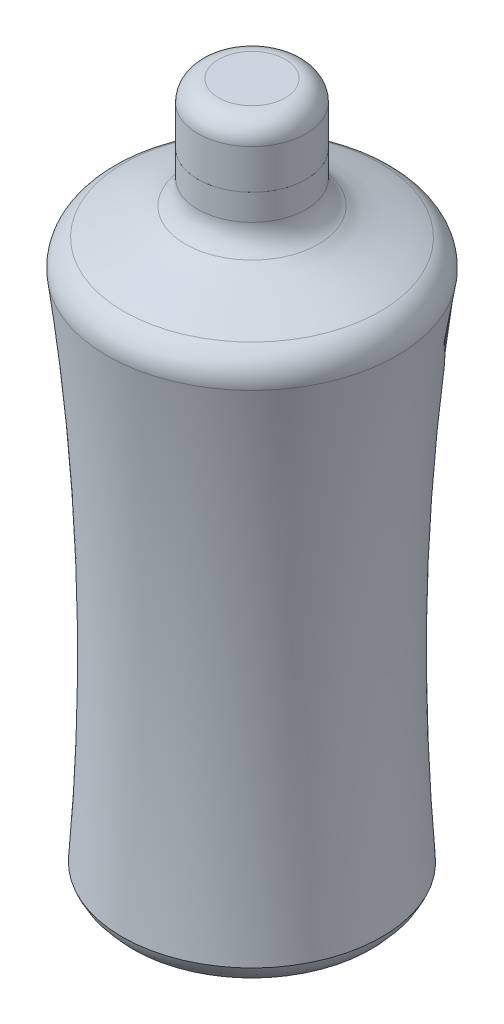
ISO-10303-21;
HEADER;
FILE_DESCRIPTION(('STEP AP214'),'2;1');
FILE_NAME('part.step','',(''),(''),'','','');
FILE_SCHEMA(('AUTOMOTIVE_DESIGN { 1 0 10303 214 1 1 1 1 }'));
ENDSEC;
DATA;
#1=APPLICATION_CONTEXT('core data for automotive mechanical design processes');
#2=APPLICATION_PROTOCOL_DEFINITION('international standard','automotive_design',2000,#1);
#3=PRODUCT_CONTEXT('',#1,'mechanical');
#4=PRODUCT('Part','Part','',(#3));
#5=PRODUCT_RELATED_PRODUCT_CATEGORY('part','',(#4));
#6=PRODUCT_DEFINITION_FORMATION('','',#4);
#7=PRODUCT_DEFINITION_CONTEXT('part definition',#1,'design');
#8=PRODUCT_DEFINITION('design','',#6,#7);
#9=PRODUCT_DEFINITION_SHAPE('','',#8);
#10=(LENGTH_UNIT() NAMED_UNIT(*) SI_UNIT(.MILLI.,.METRE.));
#11=(NAMED_UNIT(*) PLANE_ANGLE_UNIT() SI_UNIT($,.RADIAN.));
#12=(NAMED_UNIT(*) SI_UNIT($,.STERADIAN.) SOLID_ANGLE_UNIT());
#13=UNCERTAINTY_MEASURE_WITH_UNIT(LENGTH_MEASURE(1.E-05),#10,'distance_accuracy_value','');
#14=(GEOMETRIC_REPRESENTATION_CONTEXT(3) GLOBAL_UNCERTAINTY_ASSIGNED_CONTEXT((#13)) GLOBAL_UNIT_ASSIGNED_CONTEXT((#10,
#11,#12)) REPRESENTATION_CONTEXT('',''));
#15=CARTESIAN_POINT('',(0.,0.,0.));
#16=DIRECTION('',(0.,0.,1.));
#17=DIRECTION('',(1.,0.,0.));
#18=AXIS2_PLACEMENT_3D('',#15,#16,#17);
#19=CARTESIAN_POINT('',(0.,395.100887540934,0.));
#20=DIRECTION('',(0.,1.,0.));
#21=DIRECTION('',(0.,0.,1.));
#22=AXIS2_PLACEMENT_3D('',#19,#20,#21);
#23=PLANE('',#22);
#24=CARTESIAN_POINT('',(0.,395.100887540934,0.));
#25=DIRECTION('',(0.,1.,0.));
#26=DIRECTION('',(0.,0.,1.));
#27=AXIS2_PLACEMENT_3D('',#24,#25,#26);
#28=CIRCLE('',#27,33.0657505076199);
#29=CARTESIAN_POINT('',(0.,395.100887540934,33.0657505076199));
#30=VERTEX_POINT('',#29);
#31=EDGE_CURVE('E11',#30,#30,#28,.T.);
#32=ORIENTED_EDGE('',*,*,#31,.F.);
#33=EDGE_LOOP('',(#32));
#34=FACE_BOUND('',#33,.T.);
#35=ADVANCED_FACE('F42',(#34),#23,.F.);
#36=CARTESIAN_POINT('',(0.,431.942700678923,0.));
#37=DIRECTION('',(0.,1.,0.));
#38=DIRECTION('',(0.,0.,1.));
#39=AXIS2_PLACEMENT_3D('',#36,#37,#38);
#40=CYLINDRICAL_SURFACE('',#39,33.0657505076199);
#41=CARTESIAN_POINT('',(0.,419.242700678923,0.));
#42=DIRECTION('',(0.,1.,0.));
#43=DIRECTION('',(0.,0.,1.));
#44=AXIS2_PLACEMENT_3D('',#41,#42,#43);
#45=CIRCLE('',#44,33.0657505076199);
#46=CARTESIAN_POINT('',(0.,419.242700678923,33.0657505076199));
#47=VERTEX_POINT('',#46);
#48=EDGE_CURVE('E48',#47,#47,#45,.T.);
#49=ORIENTED_EDGE('',*,*,#48,.F.);
#50=EDGE_LOOP('',(#49));
#51=FACE_BOUND('',#50,.T.);
#52=ORIENTED_EDGE('',*,*,#31,.T.);
#53=EDGE_LOOP('',(#52));
#54=FACE_BOUND('',#53,.T.);
#55=ADVANCED_FACE('F63',(#51,#54),#40,.T.);
#56=CARTESIAN_POINT('',(0.,419.242700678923,0.));
#57=DIRECTION('',(0.,1.,0.));
#58=DIRECTION('',(0.,0.,1.));
#59=AXIS2_PLACEMENT_3D('',#56,#57,#58);
#60=TOROIDAL_SURFACE('',#59,20.3657505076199,12.7);
#61=CARTESIAN_POINT('',(0.,431.942700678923,0.));
#62=DIRECTION('',(0.,1.,0.));
#63=DIRECTION('',(0.,0.,1.));
#64=AXIS2_PLACEMENT_3D('',#61,#62,#63);
#65=CIRCLE('',#64,20.3657505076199);
#66=CARTESIAN_POINT('',(0.,431.942700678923,20.3657505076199));
#67=VERTEX_POINT('',#66);
#68=EDGE_CURVE('E52',#67,#67,#65,.T.);
#69=ORIENTED_EDGE('',*,*,#68,.F.);
#70=EDGE_LOOP('',(#69));
#71=FACE_BOUND('',#70,.T.);
#72=ORIENTED_EDGE('',*,*,#48,.T.);
#73=EDGE_LOOP('',(#72));
#74=FACE_BOUND('',#73,.T.);
#75=ADVANCED_FACE('F61',(#71,#74),#60,.T.);
#76=CARTESIAN_POINT('',(20.3657505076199,431.942700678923,0.));
#77=DIRECTION('',(0.,-1.,0.));
#78=DIRECTION('',(0.,0.,-1.));
#79=AXIS2_PLACEMENT_3D('',#76,#77,#78);
#80=PLANE('',#79);
#81=ORIENTED_EDGE('',*,*,#68,.T.);
#82=EDGE_LOOP('',(#81));
#83=FACE_BOUND('',#82,.T.);
#84=ADVANCED_FACE('F59',(#83),#80,.F.);
#85=CLOSED_SHELL('',(#35,#55,#75,#84));
#86=MANIFOLD_SOLID_BREP('B2',#85);
#87=CARTESIAN_POINT('',(33.0839169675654,395.100887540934,0.));
#88=DIRECTION('',(0.,-1.,0.));
#89=DIRECTION('',(0.,0.,-1.));
#90=AXIS2_PLACEMENT_3D('',#87,#88,#89);
#91=PLANE('',#90);
#92=CARTESIAN_POINT('',(0.,395.100887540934,0.));
#93=DIRECTION('',(0.,1.,0.));
#94=DIRECTION('',(0.,0.,1.));
#95=AXIS2_PLACEMENT_3D('',#92,#93,#94);
#96=CIRCLE('',#95,33.0839169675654);
#97=CARTESIAN_POINT('',(0.,395.100887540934,33.0839169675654));
#98=VERTEX_POINT('',#97);
#99=EDGE_CURVE('E117',#98,#98,#96,.T.);
#100=ORIENTED_EDGE('',*,*,#99,.T.);
#101=EDGE_LOOP('',(#100));
#102=FACE_BOUND('',#101,.T.);
#103=CARTESIAN_POINT('',(0.,395.100887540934,0.));
#104=DIRECTION('',(0.,-1.,0.));
#105=DIRECTION('',(0.,0.,-1.));
#106=AXIS2_PLACEMENT_3D('',#103,#104,#105);
#107=CIRCLE('',#106,32.5759169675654);
#108=CARTESIAN_POINT('',(0.,395.100887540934,-32.5759169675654));
#109=VERTEX_POINT('',#108);
#110=EDGE_CURVE('E361',#109,#109,#107,.F.);
#111=ORIENTED_EDGE('',*,*,#110,.F.);
#112=EDGE_LOOP('',(#111));
#113=FACE_BOUND('',#112,.T.);
#114=ADVANCED_FACE('F97',(#102,#113),#91,.F.);
#115=CARTESIAN_POINT('',(79.3997741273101,17.0680698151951,0.));
#116=CARTESIAN_POINT('',(71.9626708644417,121.488373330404,0.));
#117=CARTESIAN_POINT('',(75.0376861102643,225.653277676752,0.));
#118=CARTESIAN_POINT('',(88.6205273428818,329.428470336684,0.));
#119=B_SPLINE_CURVE_WITH_KNOTS('',3,(#115,#116,#117,#118),.UNSPECIFIED.,.F.,.F.,(4,4),(0.,
0.960351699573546),.UNSPECIFIED.);
#120=CARTESIAN_POINT('',(0.,395.100887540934,0.));
#121=DIRECTION('',(0.,1.,0.));
#122=AXIS1_PLACEMENT('',#120,#121);
#123=SURFACE_OF_REVOLUTION('',#119,#122);
#124=CARTESIAN_POINT('',(0.,329.428470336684,0.));
#125=DIRECTION('',(0.,1.,0.));
#126=DIRECTION('',(0.,0.,1.));
#127=AXIS2_PLACEMENT_3D('',#124,#125,#126);
#128=CIRCLE('',#127,88.6205273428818);
#129=CARTESIAN_POINT('',(0.,329.428470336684,88.6205273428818));
#130=VERTEX_POINT('',#129);
#131=EDGE_CURVE('E41',#130,#130,#128,.T.);
#132=ORIENTED_EDGE('',*,*,#131,.F.);
#133=EDGE_LOOP('',(#132));
#134=FACE_BOUND('',#133,.T.);
#135=CARTESIAN_POINT('',(0.,17.068069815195,0.));
#136=DIRECTION('',(0.,1.,0.));
#137=DIRECTION('',(0.,0.,1.));
#138=AXIS2_PLACEMENT_3D('',#135,#136,#137);
#139=CIRCLE('',#138,79.3997741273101);
#140=CARTESIAN_POINT('',(0.,17.068069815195,79.3997741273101));
#141=VERTEX_POINT('',#140);
#142=EDGE_CURVE('E129',#141,#141,#139,.T.);
#143=ORIENTED_EDGE('',*,*,#142,.T.);
#144=EDGE_LOOP('',(#143));
#145=FACE_BOUND('',#144,.T.);
#146=ADVANCED_FACE('F198',(#134,#145),#123,.T.);
#147=CARTESIAN_POINT('',(0.,331.735962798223,0.));
#148=DIRECTION('',(0.,1.,0.));
#149=DIRECTION('',(0.,0.,1.));
#150=AXIS2_PLACEMENT_3D('',#147,#148,#149);
#151=TOROIDAL_SURFACE('',#150,70.9908966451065,17.78);
#152=CARTESIAN_POINT('',(0.,347.866052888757,0.));
#153=DIRECTION('',(0.,1.,0.));
#154=DIRECTION('',(0.,0.,1.));
#155=AXIS2_PLACEMENT_3D('',#152,#153,#154);
#156=CIRCLE('',#155,78.4707759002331);
#157=CARTESIAN_POINT('',(0.,347.866052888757,78.4707759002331));
#158=VERTEX_POINT('',#157);
#159=EDGE_CURVE('E104',#158,#158,#156,.T.);
#160=ORIENTED_EDGE('',*,*,#159,.F.);
#161=EDGE_LOOP('',(#160));
#162=FACE_BOUND('',#161,.T.);
#163=ORIENTED_EDGE('',*,*,#131,.T.);
#164=EDGE_LOOP('',(#163));
#165=FACE_BOUND('',#164,.T.);
#166=ADVANCED_FACE('F99',(#162,#165),#151,.T.);
#167=CARTESIAN_POINT('',(78.4707759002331,347.866052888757,0.));
#168=CARTESIAN_POINT('',(67.4060142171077,352.997027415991,0.));
#169=CARTESIAN_POINT('',(47.7666690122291,358.994002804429,0.));
#170=CARTESIAN_POINT('',(41.9762248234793,363.708135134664,0.));
#171=CARTESIAN_POINT('',(40.7196665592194,364.581078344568,0.));
#172=B_SPLINE_CURVE_WITH_KNOTS('',3,(#167,#168,#169,#170,#171),.UNSPECIFIED.,.F.,.F.,(4,1,4),
(0.136476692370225,0.516914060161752,0.609088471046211),.UNSPECIFIED.);
#173=CARTESIAN_POINT('',(0.,395.100887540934,0.));
#174=DIRECTION('',(0.,1.,0.));
#175=AXIS1_PLACEMENT('',#173,#174);
#176=SURFACE_OF_REVOLUTION('',#172,#175);
#177=CARTESIAN_POINT('',(0.,364.581078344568,0.));
#178=DIRECTION('',(0.,1.,0.));
#179=DIRECTION('',(0.,0.,1.));
#180=AXIS2_PLACEMENT_3D('',#177,#178,#179);
#181=CIRCLE('',#180,40.7196665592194);
#182=CARTESIAN_POINT('',(0.,364.581078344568,40.7196665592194));
#183=VERTEX_POINT('',#182);
#184=EDGE_CURVE('E108',#183,#183,#181,.T.);
#185=ORIENTED_EDGE('',*,*,#184,.F.);
#186=EDGE_LOOP('',(#185));
#187=FACE_BOUND('',#186,.T.);
#188=ORIENTED_EDGE('',*,*,#159,.T.);
#189=EDGE_LOOP('',(#188));
#190=FACE_BOUND('',#189,.T.);
#191=ADVANCED_FACE('F145',(#187,#190),#176,.T.);
#192=CARTESIAN_POINT('',(0.,379.183221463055,0.));
#193=DIRECTION('',(0.,1.,0.));
#194=DIRECTION('',(0.,0.,1.));
#195=AXIS2_PLACEMENT_3D('',#192,#193,#194);
#196=TOROIDAL_SURFACE('',#195,50.8639169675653,17.78);
#197=CARTESIAN_POINT('',(0.,379.183221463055,0.));
#198=DIRECTION('',(0.,1.,0.));
#199=DIRECTION('',(0.,0.,1.));
#200=AXIS2_PLACEMENT_3D('',#197,#198,#199);
#201=CIRCLE('',#200,33.0839169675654);
#202=CARTESIAN_POINT('',(0.,379.183221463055,33.0839169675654));
#203=VERTEX_POINT('',#202);
#204=EDGE_CURVE('E112',#203,#203,#201,.T.);
#205=ORIENTED_EDGE('',*,*,#204,.F.);
#206=EDGE_LOOP('',(#205));
#207=FACE_BOUND('',#206,.T.);
#208=ORIENTED_EDGE('',*,*,#184,.T.);
#209=EDGE_LOOP('',(#208));
#210=FACE_BOUND('',#209,.T.);
#211=ADVANCED_FACE('F150',(#207,#210),#196,.F.);
#212=CARTESIAN_POINT('',(0.,395.100887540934,0.));
#213=DIRECTION('',(0.,1.,0.));
#214=DIRECTION('',(0.,0.,1.));
#215=AXIS2_PLACEMENT_3D('',#212,#213,#214);
#216=CYLINDRICAL_SURFACE('',#215,33.0839169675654);
#217=ORIENTED_EDGE('',*,*,#99,.F.);
#218=EDGE_LOOP('',(#217));
#219=FACE_BOUND('',#218,.T.);
#220=ORIENTED_EDGE('',*,*,#204,.T.);
#221=EDGE_LOOP('',(#220));
#222=FACE_BOUND('',#221,.T.);
#223=ADVANCED_FACE('F194',(#219,#222),#216,.T.);
#224=CARTESIAN_POINT('',(0.,11.3248009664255,0.));
#225=DIRECTION('',(0.,1.,0.));
#226=DIRECTION('',(0.,0.,1.));
#227=AXIS2_PLACEMENT_3D('',#224,#225,#226);
#228=PLANE('',#227);
#229=CARTESIAN_POINT('',(0.,11.3248009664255,0.));
#230=DIRECTION('',(0.,1.,0.));
#231=DIRECTION('',(0.,0.,1.));
#232=AXIS2_PLACEMENT_3D('',#229,#230,#231);
#233=CIRCLE('',#232,40.7196665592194);
#234=CARTESIAN_POINT('',(0.,11.3248009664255,40.7196665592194));
#235=VERTEX_POINT('',#234);
#236=EDGE_CURVE('E120',#235,#235,#233,.T.);
#237=ORIENTED_EDGE('',*,*,#236,.F.);
#238=EDGE_LOOP('',(#237));
#239=FACE_BOUND('',#238,.T.);
#240=ADVANCED_FACE('F190',(#239),#228,.F.);
#241=CARTESIAN_POINT('',(0.,-2.81141047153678,0.));
#242=DIRECTION('',(0.,1.,0.));
#243=DIRECTION('',(0.,0.,1.));
#244=AXIS2_PLACEMENT_3D('',#241,#242,#243);
#245=TOROIDAL_SURFACE('',#244,40.7196665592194,14.1362114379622);
#246=CARTESIAN_POINT('',(0.,6.27026999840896,0.));
#247=DIRECTION('',(0.,1.,0.));
#248=DIRECTION('',(0.,0.,1.));
#249=AXIS2_PLACEMENT_3D('',#246,#247,#248);
#250=CIRCLE('',#249,51.5527433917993);
#251=CARTESIAN_POINT('',(0.,6.27026999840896,51.5527433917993));
#252=VERTEX_POINT('',#251);
#253=EDGE_CURVE('E123',#252,#252,#250,.T.);
#254=ORIENTED_EDGE('',*,*,#253,.F.);
#255=EDGE_LOOP('',(#254));
#256=FACE_BOUND('',#255,.T.);
#257=ORIENTED_EDGE('',*,*,#236,.T.);
#258=EDGE_LOOP('',(#257));
#259=FACE_BOUND('',#258,.T.);
#260=ADVANCED_FACE('F186',(#256,#259),#245,.F.);
#261=CARTESIAN_POINT('',(0.,14.4292694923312,0.));
#262=DIRECTION('',(0.,1.,0.));
#263=DIRECTION('',(0.,0.,1.));
#264=AXIS2_PLACEMENT_3D('',#261,#262,#263);
#265=TOROIDAL_SURFACE('',#264,61.2852008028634,12.7);
#266=CARTESIAN_POINT('',(0.,3.3104423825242,0.));
#267=DIRECTION('',(0.,1.,0.));
#268=DIRECTION('',(0.,0.,1.));
#269=AXIS2_PLACEMENT_3D('',#266,#267,#268);
#270=CIRCLE('',#269,67.4221123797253);
#271=CARTESIAN_POINT('',(0.,3.3104423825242,67.4221123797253));
#272=VERTEX_POINT('',#271);
#273=EDGE_CURVE('E126',#272,#272,#270,.T.);
#274=ORIENTED_EDGE('',*,*,#273,.F.);
#275=EDGE_LOOP('',(#274));
#276=FACE_BOUND('',#275,.T.);
#277=ORIENTED_EDGE('',*,*,#253,.T.);
#278=EDGE_LOOP('',(#277));
#279=FACE_BOUND('',#278,.T.);
#280=ADVANCED_FACE('F182',(#276,#279),#265,.T.);
#281=CARTESIAN_POINT('',(0.,26.5895137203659,0.));
#282=DIRECTION('',(0.,1.,0.));
#283=DIRECTION('',(0.,0.,1.));
#284=AXIS2_PLACEMENT_3D('',#281,#282,#283);
#285=TOROIDAL_SURFACE('',#284,54.5734907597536,26.5895137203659);
#286=ORIENTED_EDGE('',*,*,#142,.F.);
#287=EDGE_LOOP('',(#286));
#288=FACE_BOUND('',#287,.T.);
#289=ORIENTED_EDGE('',*,*,#273,.T.);
#290=EDGE_LOOP('',(#289));
#291=FACE_BOUND('',#290,.T.);
#292=ADVANCED_FACE('F178',(#288,#291),#285,.T.);
#293=CARTESIAN_POINT('',(79.3997741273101,17.0680698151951,0.));
#294=CARTESIAN_POINT('',(71.9626708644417,121.488373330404,0.));
#295=CARTESIAN_POINT('',(75.0376861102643,225.653277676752,0.));
#296=CARTESIAN_POINT('',(88.6205273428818,329.428470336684,0.));
#297=B_SPLINE_CURVE_WITH_KNOTS('',3,(#293,#294,#295,#296),.UNSPECIFIED.,.F.,.F.,(4,4),(0.,
0.960351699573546),.UNSPECIFIED.);
#298=CARTESIAN_POINT('',(0.,395.100887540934,0.));
#299=DIRECTION('',(0.,1.,0.));
#300=AXIS1_PLACEMENT('',#298,#299);
#301=SURFACE_OF_REVOLUTION('',#297,#300);
#302=OFFSET_SURFACE('',#301,-0.508,.F.);
#303=CARTESIAN_POINT('',(0.,329.494398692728,0.));
#304=DIRECTION('',(0.,1.,0.));
#305=DIRECTION('',(0.,0.,1.));
#306=AXIS2_PLACEMENT_3D('',#303,#304,#305);
#307=CIRCLE('',#306,88.1168236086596);
#308=CARTESIAN_POINT('',(0.,329.494398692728,88.1168236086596));
#309=VERTEX_POINT('',#308);
#310=EDGE_CURVE('E132',#309,#309,#307,.T.);
#311=ORIENTED_EDGE('',*,*,#310,.T.);
#312=EDGE_LOOP('',(#311));
#313=FACE_BOUND('',#312,.T.);
#314=CARTESIAN_POINT('',(0.,17.1451591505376,0.));
#315=DIRECTION('',(0.,1.,0.));
#316=DIRECTION('',(0.,0.,1.));
#317=AXIS2_PLACEMENT_3D('',#314,#315,#316);
#318=CIRCLE('',#317,78.8850008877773);
#319=CARTESIAN_POINT('',(0.,17.1451591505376,78.8850008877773));
#320=VERTEX_POINT('',#319);
#321=EDGE_CURVE('E357',#320,#320,#318,.T.);
#322=ORIENTED_EDGE('',*,*,#321,.F.);
#323=EDGE_LOOP('',(#322));
#324=FACE_BOUND('',#323,.T.);
#325=ADVANCED_FACE('F181',(#313,#324),#302,.F.);
#326=CARTESIAN_POINT('',(0.,331.735962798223,0.));
#327=DIRECTION('',(0.,1.,0.));
#328=DIRECTION('',(0.,0.,1.));
#329=AXIS2_PLACEMENT_3D('',#326,#327,#328);
#330=TOROIDAL_SURFACE('',#329,70.9908966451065,17.272);
#331=CARTESIAN_POINT('',(0.,347.405193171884,0.));
#332=DIRECTION('',(0.,1.,0.));
#333=DIRECTION('',(1.,0.,0.));
#334=AXIS2_PLACEMENT_3D('',#331,#332,#333);
#335=CIRCLE('',#334,78.2570650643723);
#336=CARTESIAN_POINT('',(78.2570650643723,347.405193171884,0.));
#337=VERTEX_POINT('',#336);
#338=EDGE_CURVE('E350',#337,#337,#335,.T.);
#339=ORIENTED_EDGE('',*,*,#338,.T.);
#340=EDGE_LOOP('',(#339));
#341=FACE_BOUND('',#340,.T.);
#342=ORIENTED_EDGE('',*,*,#310,.F.);
#343=EDGE_LOOP('',(#342));
#344=FACE_BOUND('',#343,.T.);
#345=ADVANCED_FACE('F241',(#341,#344),#330,.F.);
#346=CARTESIAN_POINT('',(78.4707759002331,347.866052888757,0.));
#347=CARTESIAN_POINT('',(67.4060142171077,352.997027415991,0.));
#348=CARTESIAN_POINT('',(47.7666690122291,358.994002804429,0.));
#349=CARTESIAN_POINT('',(41.9762248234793,363.708135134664,0.));
#350=CARTESIAN_POINT('',(40.7196665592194,364.581078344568,0.));
#351=B_SPLINE_CURVE_WITH_KNOTS('',3,(#346,#347,#348,#349,#350),.UNSPECIFIED.,.F.,.F.,(4,1,4),
(0.136476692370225,0.516914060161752,0.609088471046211),.UNSPECIFIED.);
#352=CARTESIAN_POINT('',(0.,395.100887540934,0.));
#353=DIRECTION('',(0.,1.,0.));
#354=AXIS1_PLACEMENT('',#352,#353);
#355=SURFACE_OF_REVOLUTION('',#351,#354);
#356=OFFSET_SURFACE('',#355,-0.508,.F.);
#357=CARTESIAN_POINT('',(0.,364.163874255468,0.));
#358=DIRECTION('',(0.,1.,0.));
#359=DIRECTION('',(0.,0.,1.));
#360=AXIS2_PLACEMENT_3D('',#357,#358,#359);
#361=CIRCLE('',#360,40.4298308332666);
#362=CARTESIAN_POINT('',(0.,364.163874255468,40.4298308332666));
#363=VERTEX_POINT('',#362);
#364=EDGE_CURVE('E347',#363,#363,#361,.T.);
#365=ORIENTED_EDGE('',*,*,#364,.T.);
#366=EDGE_LOOP('',(#365));
#367=FACE_BOUND('',#366,.T.);
#368=ORIENTED_EDGE('',*,*,#338,.F.);
#369=EDGE_LOOP('',(#368));
#370=FACE_BOUND('',#369,.T.);
#371=ADVANCED_FACE('F152',(#367,#370),#356,.F.);
#372=CARTESIAN_POINT('',(0.,379.183221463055,0.));
#373=DIRECTION('',(0.,1.,0.));
#374=DIRECTION('',(0.,0.,1.));
#375=AXIS2_PLACEMENT_3D('',#372,#373,#374);
#376=TOROIDAL_SURFACE('',#375,50.8639169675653,18.288);
#377=CARTESIAN_POINT('',(0.,379.183221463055,0.));
#378=DIRECTION('',(0.,1.,0.));
#379=DIRECTION('',(0.,0.,1.));
#380=AXIS2_PLACEMENT_3D('',#377,#378,#379);
#381=CIRCLE('',#380,32.5759169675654);
#382=CARTESIAN_POINT('',(0.,379.183221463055,32.5759169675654));
#383=VERTEX_POINT('',#382);
#384=EDGE_CURVE('E354',#383,#383,#381,.T.);
#385=ORIENTED_EDGE('',*,*,#384,.T.);
#386=EDGE_LOOP('',(#385));
#387=FACE_BOUND('',#386,.T.);
#388=ORIENTED_EDGE('',*,*,#364,.F.);
#389=EDGE_LOOP('',(#388));
#390=FACE_BOUND('',#389,.T.);
#391=ADVANCED_FACE('F154',(#387,#390),#376,.T.);
#392=CARTESIAN_POINT('',(0.,395.100887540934,0.));
#393=DIRECTION('',(0.,1.,0.));
#394=DIRECTION('',(0.,0.,1.));
#395=AXIS2_PLACEMENT_3D('',#392,#393,#394);
#396=CYLINDRICAL_SURFACE('',#395,32.5759169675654);
#397=ORIENTED_EDGE('',*,*,#110,.T.);
#398=EDGE_LOOP('',(#397));
#399=FACE_BOUND('',#398,.T.);
#400=ORIENTED_EDGE('',*,*,#384,.F.);
#401=EDGE_LOOP('',(#400));
#402=FACE_BOUND('',#401,.T.);
#403=ADVANCED_FACE('F157',(#399,#402),#396,.F.);
#404=CARTESIAN_POINT('',(0.,11.8328009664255,0.));
#405=DIRECTION('',(0.,1.,0.));
#406=DIRECTION('',(0.,0.,1.));
#407=AXIS2_PLACEMENT_3D('',#404,#405,#406);
#408=PLANE('',#407);
#409=CARTESIAN_POINT('',(0.,11.8328009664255,0.));
#410=DIRECTION('',(0.,1.,0.));
#411=DIRECTION('',(0.,0.,1.));
#412=AXIS2_PLACEMENT_3D('',#409,#410,#411);
#413=CIRCLE('',#412,40.7196665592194);
#414=CARTESIAN_POINT('',(0.,11.8328009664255,40.7196665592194));
#415=VERTEX_POINT('',#414);
#416=EDGE_CURVE('E368',#415,#415,#413,.T.);
#417=ORIENTED_EDGE('',*,*,#416,.T.);
#418=EDGE_LOOP('',(#417));
#419=FACE_BOUND('',#418,.T.);
#420=ADVANCED_FACE('F161',(#419),#408,.T.);
#421=CARTESIAN_POINT('',(0.,-2.81141047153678,0.));
#422=DIRECTION('',(0.,1.,0.));
#423=DIRECTION('',(0.,0.,1.));
#424=AXIS2_PLACEMENT_3D('',#421,#422,#423);
#425=TOROIDAL_SURFACE('',#424,40.7196665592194,14.6442114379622);
#426=CARTESIAN_POINT('',(0.,6.59662997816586,0.));
#427=DIRECTION('',(0.,1.,0.));
#428=DIRECTION('',(0.,0.,1.));
#429=AXIS2_PLACEMENT_3D('',#426,#427,#428);
#430=CIRCLE('',#429,51.9420416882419);
#431=CARTESIAN_POINT('',(0.,6.59662997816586,51.9420416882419));
#432=VERTEX_POINT('',#431);
#433=EDGE_CURVE('E365',#432,#432,#430,.T.);
#434=ORIENTED_EDGE('',*,*,#433,.T.);
#435=EDGE_LOOP('',(#434));
#436=FACE_BOUND('',#435,.T.);
#437=ORIENTED_EDGE('',*,*,#416,.F.);
#438=EDGE_LOOP('',(#437));
#439=FACE_BOUND('',#438,.T.);
#440=ADVANCED_FACE('F165',(#436,#439),#425,.T.);
#441=CARTESIAN_POINT('',(0.,14.4292694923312,0.));
#442=DIRECTION('',(0.,1.,0.));
#443=DIRECTION('',(0.,0.,1.));
#444=AXIS2_PLACEMENT_3D('',#441,#442,#443);
#445=TOROIDAL_SURFACE('',#444,61.2852008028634,12.192);
#446=CARTESIAN_POINT('',(0.,3.75519546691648,0.));
#447=DIRECTION('',(0.,1.,0.));
#448=DIRECTION('',(0.,0.,1.));
#449=AXIS2_PLACEMENT_3D('',#446,#447,#448);
#450=CIRCLE('',#449,67.1766359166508);
#451=CARTESIAN_POINT('',(0.,3.75519546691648,67.1766359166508));
#452=VERTEX_POINT('',#451);
#453=EDGE_CURVE('E362',#452,#452,#450,.T.);
#454=ORIENTED_EDGE('',*,*,#453,.T.);
#455=EDGE_LOOP('',(#454));
#456=FACE_BOUND('',#455,.T.);
#457=ORIENTED_EDGE('',*,*,#433,.F.);
#458=EDGE_LOOP('',(#457));
#459=FACE_BOUND('',#458,.T.);
#460=ADVANCED_FACE('F169',(#456,#459),#445,.F.);
#461=CARTESIAN_POINT('',(0.,26.5895137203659,0.));
#462=DIRECTION('',(0.,1.,0.));
#463=DIRECTION('',(0.,0.,1.));
#464=AXIS2_PLACEMENT_3D('',#461,#462,#463);
#465=TOROIDAL_SURFACE('',#464,54.5734907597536,26.0815137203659);
#466=ORIENTED_EDGE('',*,*,#321,.T.);
#467=EDGE_LOOP('',(#466));
#468=FACE_BOUND('',#467,.T.);
#469=ORIENTED_EDGE('',*,*,#453,.F.);
#470=EDGE_LOOP('',(#469));
#471=FACE_BOUND('',#470,.T.);
#472=ADVANCED_FACE('F173',(#468,#471),#465,.F.);
#473=CLOSED_SHELL('',(#114,#146,#166,#191,#211,#223,#240,#260,#280,#292,#325,#345,#371,#391,
#403,#420,#440,#460,#472));
#474=MANIFOLD_SOLID_BREP('B6',#473);
#475=ADVANCED_BREP_SHAPE_REPRESENTATION('',(#18,#86,#474),#14);
#476=SHAPE_DEFINITION_REPRESENTATION(#9,#475);
ENDSEC;
END-ISO-10303-21;
